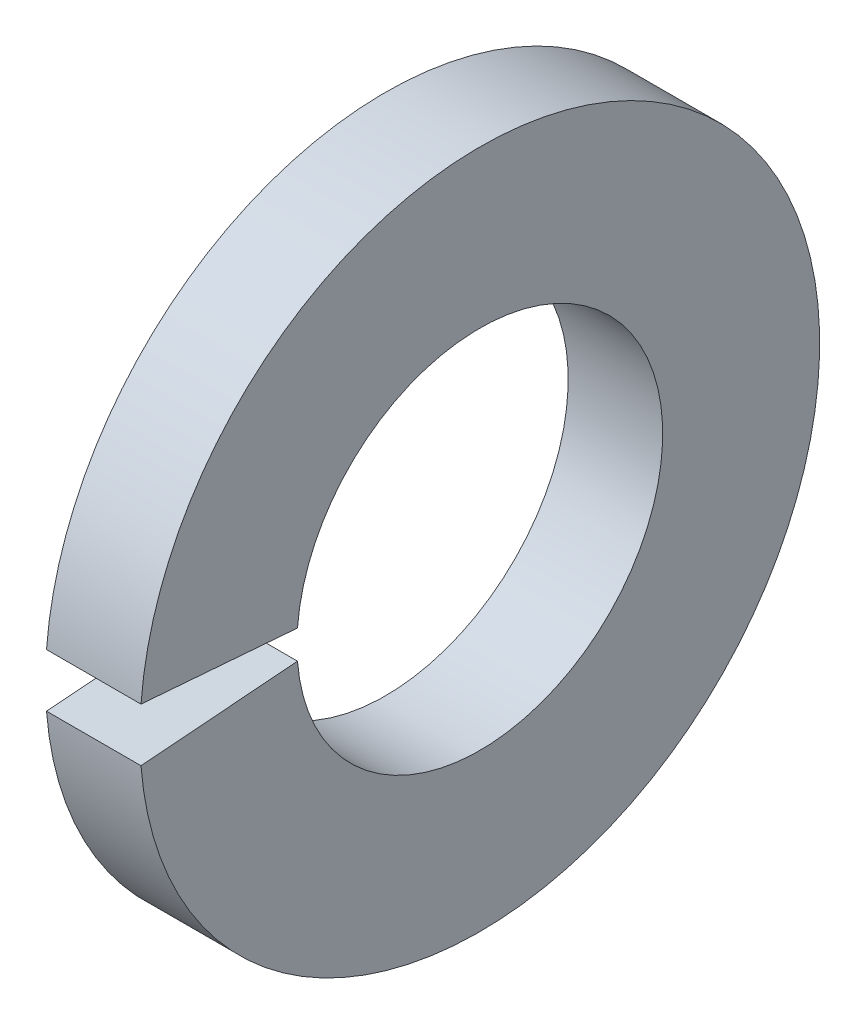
from build123d import *

# Parameters (mm, degrees)
SKETCH1_W = 0.7874
SKETCH1_H = 1.3081
GAP_DEPTH = 5.081859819


with BuildPart() as part:
    # Sketch1 → Base-Revolve (revolve)
    with BuildSketch(Plane.XY, mode=Mode.PRIVATE) as base_revolve_sk:
        with Locations((-0.3937, 2.17805)):
            Rectangle(SKETCH1_W, SKETCH1_H)
    revolve(base_revolve_sk.sketch.rotate(Axis((-34.925, 0, 0), (1, 0, 0)), 90), axis=Axis((-34.925, 0, 0), (1, 0, 0)))

    # Sketch2 → Gap (cut, through all)
    with BuildSketch(Plane(origin=(0, 0, 0), x_dir=(0, -1, 0), z_dir=(-1, 0, 0))):
        with BuildLine():
            Line((0, 0), (0.226648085, 2.879836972))
            ThreePointArc((0.226648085, 2.879836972), (0, 2.888742), (-0.226648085, 2.879836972))
            Line((-0.226648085, 2.879836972), (0, 0))
        make_face()
    extrude(amount=GAP_DEPTH, mode=Mode.SUBTRACT)


solid = part.part
